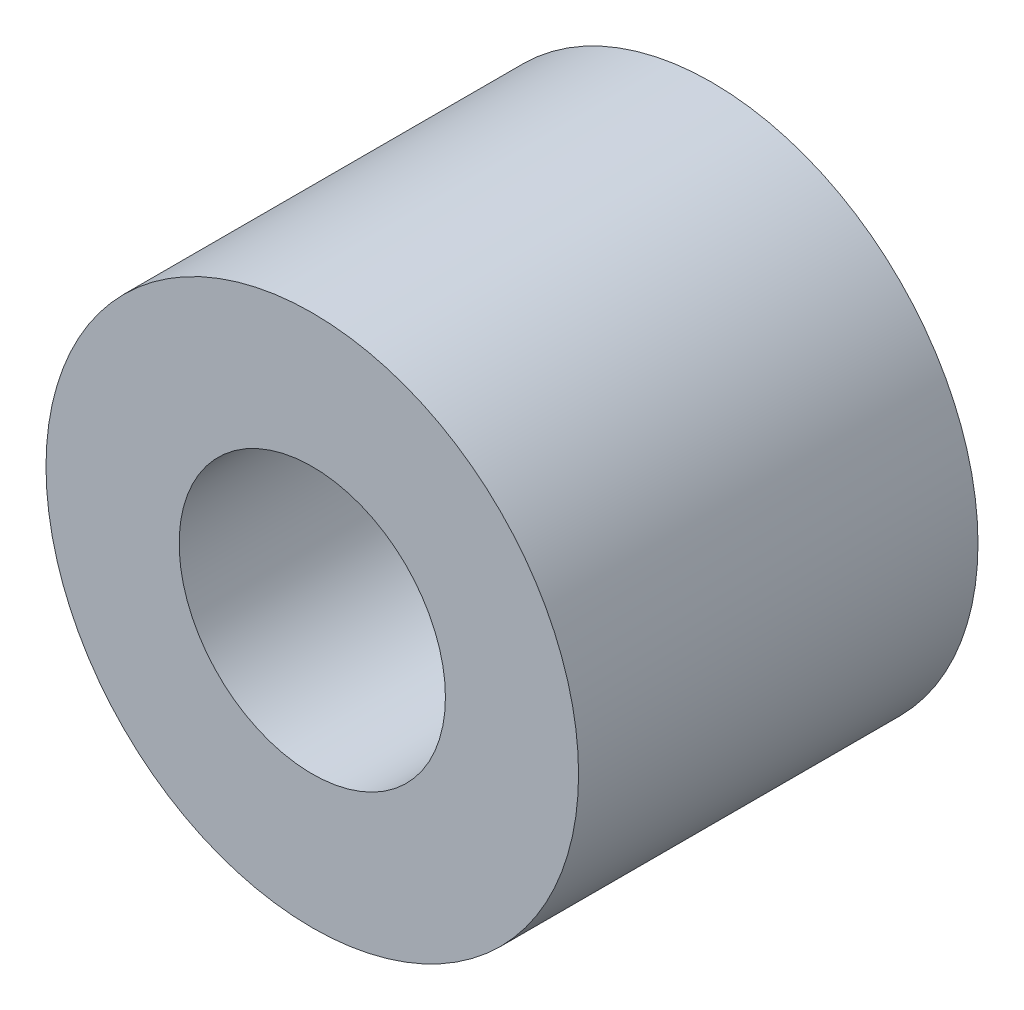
from build123d import *

# Parameters (mm, degrees)
ESQUISSE1_R            = 10
ESQUISSE1_R_2          = 5
BASE_EXTRU_MINCE_DEPTH = 15


with BuildPart() as part:
    # Esquisse1 → Base-Extru.-Mince (new body)
    with BuildSketch(Plane.XY):
        Circle(ESQUISSE1_R)
        Circle(ESQUISSE1_R_2, mode=Mode.SUBTRACT)
    extrude(amount=BASE_EXTRU_MINCE_DEPTH)


solid = part.part
